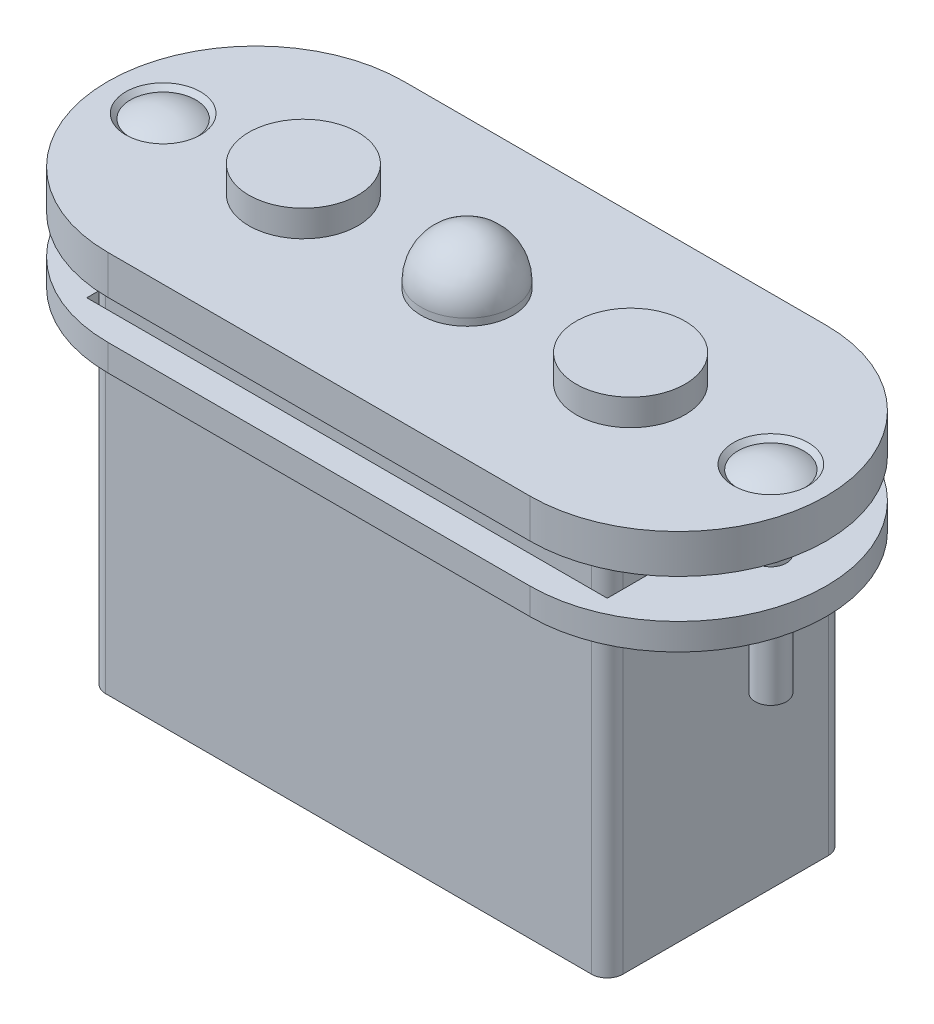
from build123d import *

# Parameters (mm, degrees)
BOSS_EXTRU_1_DEPTH                             = 2.5
ESQUISSE2_W                                    = 33.2
ESQUISSE2_H                                    = 15.2
BOSS_EXTRU_2_DEPTH                             = 24
CONG_1_R                                       = 1
FRAISAGE_POUR_VIS_T_TE_FRAIS_E_M21_D           = 2.1
FRAISAGE_POUR_VIS_T_TE_FRAIS_E_M21_CSINK_D     = 4.8
FRAISAGE_POUR_VIS_T_TE_FRAIS_E_M21_CSINK_ANGLE = 90
ESQUISSE5_R                                    = 3.5
BOSS_EXTRU_3_DEPTH                             = 1.7
ESQUISSE9_W                                    = 33.4
ESQUISSE9_H                                    = 15.4
BOSS_EXTRU_4_DEPTH                             = 1.7
R_P_TITION_LIN_AIRE1_COUNT                     = 2
R_P_TITION_LIN_AIRE1_PITCH                     = 39


with BuildPart() as part:
    # Esquisse1 → Boss.-Extru.1 (new body)
    with BuildSketch(Plane(origin=(0, 0, 0), x_dir=(1, 0, 0), z_dir=(0, 1, 0))):
        with BuildLine():
            Line((-13.55, 9.5), (13.55, 9.5))
            ThreePointArc((13.55, 9.5), (23.05, 0), (13.55, -9.5))
            Line((13.55, -9.5), (-13.55, -9.5))
            ThreePointArc((-13.55, -9.5), (-23.05, 0), (-13.55, 9.5))
        make_face()
    extrude(amount=BOSS_EXTRU_1_DEPTH)

    # Esquisse2 → Boss.-Extru.2 (add)
    with BuildSketch(Plane.XZ):
        Rectangle(ESQUISSE2_W, ESQUISSE2_H)
    extrude(amount=BOSS_EXTRU_2_DEPTH)

    # Cong_1
    cong_1_edges = [part.edges().sort_by_distance(p)[0] for p in [
        (16.6, -12, -7.6),
        (16.6, -12, 7.6),
        (-16.6, -12, 7.6),
        (-16.6, -12, -7.6),
    ]]
    fillet(cong_1_edges, radius=CONG_1_R)

    # Fraisage pour vis _ t_te frais_e M21 (through all)
    with Locations(Plane(origin=(0, 2.5, 0), x_dir=(1, 0, 0), z_dir=(0, 1, 0))):
        with Locations((-19.5, 0), (19.5, 0)):
            CounterSinkHole(FRAISAGE_POUR_VIS_T_TE_FRAIS_E_M21_D / 2, FRAISAGE_POUR_VIS_T_TE_FRAIS_E_M21_CSINK_D / 2, counter_sink_angle=FRAISAGE_POUR_VIS_T_TE_FRAIS_E_M21_CSINK_ANGLE)

    # Esquisse5 → Boss.-Extru.3 (add)
    with BuildSketch(Plane(origin=(0, 2.5, 0), x_dir=(1, 0, 0), z_dir=(0, 1, 0))):
        with Locations(Location((-10.5, 0, 0), (0, 0, 270))):
            Circle(ESQUISSE5_R)
        with Locations(Location((10.5, 0, 0), (0, 0, 270))):
            Circle(ESQUISSE5_R)
    extrude(amount=BOSS_EXTRU_3_DEPTH)

    # Esquisse6 → R_volution1 (revolve)
    with BuildSketch(Plane.XY, mode=Mode.PRIVATE) as r_volution1_sk:
        with BuildLine():
            Line((0, 2.5), (-2.95, 2.5))
            Line((-2.95, 2.5), (-2.95, 2.95))
            ThreePointArc((-2.95, 2.95), (-2.085965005, 5.035965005), (0, 5.9))
            Line((0, 5.9), (0, 2.5))
        make_face()
    revolve(r_volution1_sk.sketch.rotate(Axis((0, 0, 0), (0, 1, 0)), 270), axis=Axis((0, 0, 0), (0, 1, 0)))

    # Balayage1: sweep along a path in Esquisse8
    with BuildLine(Plane.ZY.offset(6.1)) as balayage1_path:
        Line((1.4, -24), (1.4, -25))
        ThreePointArc((1.4, -25), (0.814213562, -26.414213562), (-0.6, -27))
        Line((-0.6, -27), (-6.6, -27))
    # Esquisse7 → Balayage1 (sweep)
    with BuildSketch(Plane.XZ.offset(24)):
        with BuildLine():
            Line((-10.6, 1.9), (-1.6, 1.9))
            ThreePointArc((-1.6, 1.9), (-1.1, 1.4), (-1.6, 0.9))
            Line((-1.6, 0.9), (-10.6, 0.9))
            ThreePointArc((-10.6, 0.9), (-11.1, 1.4), (-10.6, 1.9))
        make_face()
    sweep(path=balayage1_path.line)


with BuildPart() as body_2:
    # Esquisse9 → Boss.-Extru.4 (new body)
    with BuildSketch(Plane(origin=(0, -2.5, 0), x_dir=(-1, 0, 0), z_dir=(0, -1, 0))):
        with BuildLine():
            Line((13.55, 9.5), (-13.55, 9.5))
            ThreePointArc((-13.55, 9.5), (-23.05, 0), (-13.55, -9.5))
            Line((-13.55, -9.5), (13.55, -9.5))
            ThreePointArc((13.55, -9.5), (23.05, 0), (13.55, 9.5))
        make_face()
        Rectangle(ESQUISSE9_W, ESQUISSE9_H, mode=Mode.SUBTRACT)
    extrude(amount=BOSS_EXTRU_4_DEPTH)


with BuildPart() as body_3:
    # Esquisse10 → R_volution2 (revolve)
    with BuildSketch(Plane.XY, mode=Mode.PRIVATE) as r_volution2_sk:
        with BuildLine():
            Line((-21.6, 2.2), (-20.5, 1.1))
            Line((-20.5, 1.1), (-20.5, -10.2))
            Line((-20.5, -10.2), (-19.5, -10.2))
            Line((-19.5, -10.2), (-19.5, 2.8))
            ThreePointArc((-19.5, 2.8), (-20.592016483, 2.647057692), (-21.6, 2.2))
        make_face()
    revolve(r_volution2_sk.sketch.rotate(Axis((-19.5, 1.15, 0), (0, -1, 0)), 270), axis=Axis((-19.5, 1.15, 0), (0, -1, 0)))


with BuildPart() as r_p_tition_lin_aire1_1:
    # R_p_tition lin_aire1: pattern copy
    add(body_3.part.moved(Location(Vector(1, 0, 0) * (1 * R_P_TITION_LIN_AIRE1_PITCH))))


solid = Compound([part.part, body_2.part, body_3.part, r_p_tition_lin_aire1_1.part])
